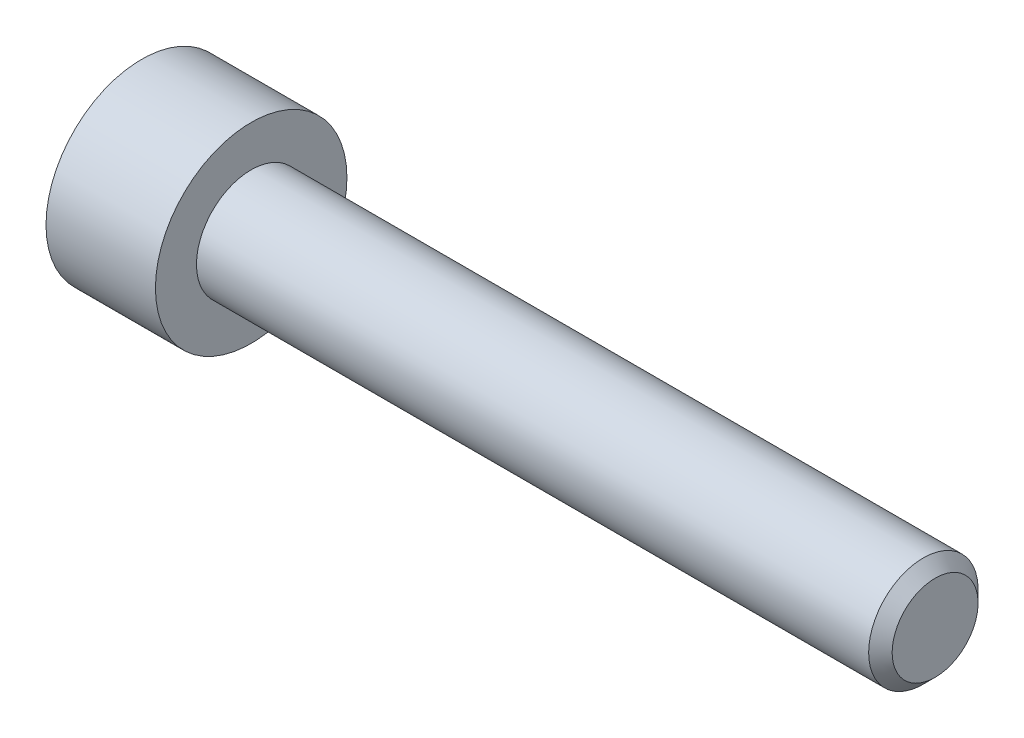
ISO-10303-21;
HEADER;
FILE_DESCRIPTION(('STEP AP214'),'2;1');
FILE_NAME('part.step','',(''),(''),'','','');
FILE_SCHEMA(('AUTOMOTIVE_DESIGN { 1 0 10303 214 1 1 1 1 }'));
ENDSEC;
DATA;
#1=APPLICATION_CONTEXT('core data for automotive mechanical design processes');
#2=APPLICATION_PROTOCOL_DEFINITION('international standard','automotive_design',2000,#1);
#3=PRODUCT_CONTEXT('',#1,'mechanical');
#4=PRODUCT('Part','Part','',(#3));
#5=PRODUCT_RELATED_PRODUCT_CATEGORY('part','',(#4));
#6=PRODUCT_DEFINITION_FORMATION('','',#4);
#7=PRODUCT_DEFINITION_CONTEXT('part definition',#1,'design');
#8=PRODUCT_DEFINITION('design','',#6,#7);
#9=PRODUCT_DEFINITION_SHAPE('','',#8);
#10=(LENGTH_UNIT() NAMED_UNIT(*) SI_UNIT(.MILLI.,.METRE.));
#11=(NAMED_UNIT(*) PLANE_ANGLE_UNIT() SI_UNIT($,.RADIAN.));
#12=(NAMED_UNIT(*) SI_UNIT($,.STERADIAN.) SOLID_ANGLE_UNIT());
#13=UNCERTAINTY_MEASURE_WITH_UNIT(LENGTH_MEASURE(1.E-05),#10,'distance_accuracy_value','');
#14=(GEOMETRIC_REPRESENTATION_CONTEXT(3) GLOBAL_UNCERTAINTY_ASSIGNED_CONTEXT((#13)) GLOBAL_UNIT_ASSIGNED_CONTEXT((#10,
#11,#12)) REPRESENTATION_CONTEXT('',''));
#15=CARTESIAN_POINT('',(0.,0.,0.));
#16=DIRECTION('',(0.,0.,1.));
#17=DIRECTION('',(1.,0.,0.));
#18=AXIS2_PLACEMENT_3D('',#15,#16,#17);
#19=CARTESIAN_POINT('',(-2.,0.86602540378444,1.5));
#20=DIRECTION('',(1.,0.,0.));
#21=DIRECTION('',(0.,0.,-1.));
#22=AXIS2_PLACEMENT_3D('',#19,#20,#21);
#23=PLANE('',#22);
#24=DIRECTION('',(0.,-0.500000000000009,0.866025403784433));
#25=VECTOR('',#24,1.);
#26=CARTESIAN_POINT('',(-2.,1.7320508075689,0.));
#27=LINE('',#26,#25);
#28=CARTESIAN_POINT('',(-2.,1.7320508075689,0.));
#29=VERTEX_POINT('',#28);
#30=CARTESIAN_POINT('',(-2.,0.86602540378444,1.5));
#31=VERTEX_POINT('',#30);
#32=EDGE_CURVE('E132',#29,#31,#27,.T.);
#33=ORIENTED_EDGE('',*,*,#32,.F.);
#34=DIRECTION('',(0.,0.500000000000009,0.866025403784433));
#35=VECTOR('',#34,1.);
#36=CARTESIAN_POINT('',(-2.,0.86602540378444,-1.5));
#37=LINE('',#36,#35);
#38=CARTESIAN_POINT('',(-2.,0.86602540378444,-1.5));
#39=VERTEX_POINT('',#38);
#40=EDGE_CURVE('E54',#39,#29,#37,.T.);
#41=ORIENTED_EDGE('',*,*,#40,.F.);
#42=DIRECTION('',(0.,1.,0.));
#43=VECTOR('',#42,1.);
#44=CARTESIAN_POINT('',(-2.,-0.86602540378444,-1.5));
#45=LINE('',#44,#43);
#46=CARTESIAN_POINT('',(-2.,-0.86602540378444,-1.5));
#47=VERTEX_POINT('',#46);
#48=EDGE_CURVE('E104',#47,#39,#45,.T.);
#49=ORIENTED_EDGE('',*,*,#48,.F.);
#50=DIRECTION('',(0.,0.500000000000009,-0.866025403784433));
#51=VECTOR('',#50,1.);
#52=CARTESIAN_POINT('',(-2.,-1.7320508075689,0.));
#53=LINE('',#52,#51);
#54=CARTESIAN_POINT('',(-2.,-1.7320508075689,0.));
#55=VERTEX_POINT('',#54);
#56=EDGE_CURVE('E97',#55,#47,#53,.T.);
#57=ORIENTED_EDGE('',*,*,#56,.F.);
#58=DIRECTION('',(0.,-0.500000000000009,-0.866025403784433));
#59=VECTOR('',#58,1.);
#60=CARTESIAN_POINT('',(-2.,-0.86602540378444,1.5));
#61=LINE('',#60,#59);
#62=CARTESIAN_POINT('',(-2.,-0.86602540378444,1.5));
#63=VERTEX_POINT('',#62);
#64=EDGE_CURVE('E105',#63,#55,#61,.T.);
#65=ORIENTED_EDGE('',*,*,#64,.F.);
#66=DIRECTION('',(0.,-1.,0.));
#67=VECTOR('',#66,1.);
#68=CARTESIAN_POINT('',(-2.,0.86602540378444,1.5));
#69=LINE('',#68,#67);
#70=EDGE_CURVE('E86',#31,#63,#69,.T.);
#71=ORIENTED_EDGE('',*,*,#70,.F.);
#72=EDGE_LOOP('',(#33,#41,#49,#57,#65,#71));
#73=FACE_BOUND('',#72,.T.);
#74=CARTESIAN_POINT('',(-2.,0.,0.));
#75=DIRECTION('',(-1.,0.,0.));
#76=DIRECTION('',(0.,0.,1.));
#77=AXIS2_PLACEMENT_3D('',#74,#75,#76);
#78=CIRCLE('',#77,1.49);
#79=CARTESIAN_POINT('',(-2.,0.,1.49));
#80=VERTEX_POINT('',#79);
#81=EDGE_CURVE('E120',#80,#80,#78,.T.);
#82=ORIENTED_EDGE('',*,*,#81,.F.);
#83=EDGE_LOOP('',(#82));
#84=FACE_BOUND('',#83,.T.);
#85=ADVANCED_FACE('F31',(#73,#84),#23,.F.);
#86=CARTESIAN_POINT('',(-4.,0.,0.));
#87=DIRECTION('',(1.,0.,0.));
#88=DIRECTION('',(0.,0.,-1.));
#89=AXIS2_PLACEMENT_3D('',#86,#87,#88);
#90=PLANE('',#89);
#91=CARTESIAN_POINT('',(-4.,0.,0.));
#92=DIRECTION('',(-1.,0.,0.));
#93=DIRECTION('',(0.,0.,1.));
#94=AXIS2_PLACEMENT_3D('',#91,#92,#93);
#95=CIRCLE('',#94,3.5);
#96=CARTESIAN_POINT('',(-4.,0.,3.5));
#97=VERTEX_POINT('',#96);
#98=EDGE_CURVE('E11',#97,#97,#95,.T.);
#99=ORIENTED_EDGE('',*,*,#98,.T.);
#100=EDGE_LOOP('',(#99));
#101=FACE_BOUND('',#100,.T.);
#102=DIRECTION('',(0.,-0.500000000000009,0.866025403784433));
#103=VECTOR('',#102,1.);
#104=CARTESIAN_POINT('',(-4.,1.7320508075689,0.));
#105=LINE('',#104,#103);
#106=CARTESIAN_POINT('',(-4.,1.7320508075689,0.));
#107=VERTEX_POINT('',#106);
#108=CARTESIAN_POINT('',(-4.,0.86602540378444,1.5));
#109=VERTEX_POINT('',#108);
#110=EDGE_CURVE('E46',#107,#109,#105,.T.);
#111=ORIENTED_EDGE('',*,*,#110,.T.);
#112=DIRECTION('',(0.,-1.,0.));
#113=VECTOR('',#112,1.);
#114=CARTESIAN_POINT('',(-4.,0.86602540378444,1.5));
#115=LINE('',#114,#113);
#116=CARTESIAN_POINT('',(-4.,-0.86602540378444,1.5));
#117=VERTEX_POINT('',#116);
#118=EDGE_CURVE('E119',#109,#117,#115,.T.);
#119=ORIENTED_EDGE('',*,*,#118,.T.);
#120=DIRECTION('',(0.,-0.500000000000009,-0.866025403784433));
#121=VECTOR('',#120,1.);
#122=CARTESIAN_POINT('',(-4.,-0.86602540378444,1.5));
#123=LINE('',#122,#121);
#124=CARTESIAN_POINT('',(-4.,-1.7320508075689,0.));
#125=VERTEX_POINT('',#124);
#126=EDGE_CURVE('E123',#117,#125,#123,.T.);
#127=ORIENTED_EDGE('',*,*,#126,.T.);
#128=DIRECTION('',(0.,0.500000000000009,-0.866025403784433));
#129=VECTOR('',#128,1.);
#130=CARTESIAN_POINT('',(-4.,-1.7320508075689,0.));
#131=LINE('',#130,#129);
#132=CARTESIAN_POINT('',(-4.,-0.86602540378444,-1.5));
#133=VERTEX_POINT('',#132);
#134=EDGE_CURVE('E126',#125,#133,#131,.T.);
#135=ORIENTED_EDGE('',*,*,#134,.T.);
#136=DIRECTION('',(0.,1.,0.));
#137=VECTOR('',#136,1.);
#138=CARTESIAN_POINT('',(-4.,-0.86602540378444,-1.5));
#139=LINE('',#138,#137);
#140=CARTESIAN_POINT('',(-4.,0.86602540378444,-1.5));
#141=VERTEX_POINT('',#140);
#142=EDGE_CURVE('E109',#133,#141,#139,.T.);
#143=ORIENTED_EDGE('',*,*,#142,.T.);
#144=DIRECTION('',(0.,0.500000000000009,0.866025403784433));
#145=VECTOR('',#144,1.);
#146=CARTESIAN_POINT('',(-4.,0.86602540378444,-1.5));
#147=LINE('',#146,#145);
#148=EDGE_CURVE('E129',#141,#107,#147,.T.);
#149=ORIENTED_EDGE('',*,*,#148,.T.);
#150=EDGE_LOOP('',(#111,#119,#127,#135,#143,#149));
#151=FACE_BOUND('',#150,.T.);
#152=ADVANCED_FACE('F33',(#101,#151),#90,.F.);
#153=CARTESIAN_POINT('',(25.,0.,0.));
#154=DIRECTION('',(-1.,0.,0.));
#155=DIRECTION('',(0.,0.,1.));
#156=AXIS2_PLACEMENT_3D('',#153,#154,#155);
#157=CYLINDRICAL_SURFACE('',#156,3.5);
#158=ORIENTED_EDGE('',*,*,#98,.F.);
#159=EDGE_LOOP('',(#158));
#160=FACE_BOUND('',#159,.T.);
#161=CARTESIAN_POINT('',(0.,0.,0.));
#162=DIRECTION('',(-1.,0.,0.));
#163=DIRECTION('',(0.,0.,1.));
#164=AXIS2_PLACEMENT_3D('',#161,#162,#163);
#165=CIRCLE('',#164,3.5);
#166=CARTESIAN_POINT('',(0.,0.,3.5));
#167=VERTEX_POINT('',#166);
#168=EDGE_CURVE('E39',#167,#167,#165,.T.);
#169=ORIENTED_EDGE('',*,*,#168,.T.);
#170=EDGE_LOOP('',(#169));
#171=FACE_BOUND('',#170,.T.);
#172=ADVANCED_FACE('F151',(#160,#171),#157,.T.);
#173=CARTESIAN_POINT('',(0.,3.5,0.));
#174=DIRECTION('',(-1.,0.,0.));
#175=DIRECTION('',(0.,0.,1.));
#176=AXIS2_PLACEMENT_3D('',#173,#174,#175);
#177=PLANE('',#176);
#178=ORIENTED_EDGE('',*,*,#168,.F.);
#179=EDGE_LOOP('',(#178));
#180=FACE_BOUND('',#179,.T.);
#181=CARTESIAN_POINT('',(0.,0.,0.));
#182=DIRECTION('',(-1.,0.,0.));
#183=DIRECTION('',(0.,0.,1.));
#184=AXIS2_PLACEMENT_3D('',#181,#182,#183);
#185=CIRCLE('',#184,2.);
#186=CARTESIAN_POINT('',(0.,0.,2.));
#187=VERTEX_POINT('',#186);
#188=EDGE_CURVE('E146',#187,#187,#185,.T.);
#189=ORIENTED_EDGE('',*,*,#188,.T.);
#190=EDGE_LOOP('',(#189));
#191=FACE_BOUND('',#190,.T.);
#192=ADVANCED_FACE('F153',(#180,#191),#177,.F.);
#193=CARTESIAN_POINT('',(25.,0.,0.));
#194=DIRECTION('',(-1.,0.,0.));
#195=DIRECTION('',(0.,0.,1.));
#196=AXIS2_PLACEMENT_3D('',#193,#194,#195);
#197=CYLINDRICAL_SURFACE('',#196,2.);
#198=ORIENTED_EDGE('',*,*,#188,.F.);
#199=EDGE_LOOP('',(#198));
#200=FACE_BOUND('',#199,.T.);
#201=CARTESIAN_POINT('',(24.5705,0.,0.));
#202=DIRECTION('',(-1.,0.,0.));
#203=DIRECTION('',(0.,0.,1.));
#204=AXIS2_PLACEMENT_3D('',#201,#202,#203);
#205=CIRCLE('',#204,2.);
#206=CARTESIAN_POINT('',(24.5705,0.,2.));
#207=VERTEX_POINT('',#206);
#208=EDGE_CURVE('E143',#207,#207,#205,.T.);
#209=ORIENTED_EDGE('',*,*,#208,.T.);
#210=EDGE_LOOP('',(#209));
#211=FACE_BOUND('',#210,.T.);
#212=ADVANCED_FACE('F156',(#200,#211),#197,.T.);
#213=CARTESIAN_POINT('',(25.,0.,0.));
#214=DIRECTION('',(-1.,0.,0.));
#215=DIRECTION('',(0.,0.,1.));
#216=AXIS2_PLACEMENT_3D('',#213,#214,#215);
#217=CONICAL_SURFACE('',#216,1.5705,0.785398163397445);
#218=ORIENTED_EDGE('',*,*,#208,.F.);
#219=EDGE_LOOP('',(#218));
#220=FACE_BOUND('',#219,.T.);
#221=CARTESIAN_POINT('',(25.,0.,0.));
#222=DIRECTION('',(-1.,0.,0.));
#223=DIRECTION('',(0.,0.,1.));
#224=AXIS2_PLACEMENT_3D('',#221,#222,#223);
#225=CIRCLE('',#224,1.5705);
#226=CARTESIAN_POINT('',(25.,0.,1.5705));
#227=VERTEX_POINT('',#226);
#228=EDGE_CURVE('E140',#227,#227,#225,.T.);
#229=ORIENTED_EDGE('',*,*,#228,.T.);
#230=EDGE_LOOP('',(#229));
#231=FACE_BOUND('',#230,.T.);
#232=ADVANCED_FACE('F162',(#220,#231),#217,.T.);
#233=CARTESIAN_POINT('',(25.,1.5705,0.));
#234=DIRECTION('',(-1.,0.,0.));
#235=DIRECTION('',(0.,0.,1.));
#236=AXIS2_PLACEMENT_3D('',#233,#234,#235);
#237=PLANE('',#236);
#238=ORIENTED_EDGE('',*,*,#228,.F.);
#239=EDGE_LOOP('',(#238));
#240=FACE_BOUND('',#239,.T.);
#241=ADVANCED_FACE('F168',(#240),#237,.F.);
#242=CARTESIAN_POINT('',(-2.,1.7320508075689,0.));
#243=DIRECTION('',(0.,-0.866025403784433,-0.500000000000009));
#244=DIRECTION('',(0.,0.500000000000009,-0.866025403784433));
#245=AXIS2_PLACEMENT_3D('',#242,#243,#244);
#246=PLANE('',#245);
#247=ORIENTED_EDGE('',*,*,#110,.F.);
#248=DIRECTION('',(-1.,0.,0.));
#249=VECTOR('',#248,1.);
#250=CARTESIAN_POINT('',(-2.,1.7320508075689,0.));
#251=LINE('',#250,#249);
#252=EDGE_CURVE('E114',#29,#107,#251,.T.);
#253=ORIENTED_EDGE('',*,*,#252,.F.);
#254=ORIENTED_EDGE('',*,*,#32,.T.);
#255=DIRECTION('',(-1.,0.,0.));
#256=VECTOR('',#255,1.);
#257=CARTESIAN_POINT('',(-2.,0.86602540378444,1.5));
#258=LINE('',#257,#256);
#259=EDGE_CURVE('E138',#31,#109,#258,.T.);
#260=ORIENTED_EDGE('',*,*,#259,.T.);
#261=EDGE_LOOP('',(#247,#253,#254,#260));
#262=FACE_BOUND('',#261,.T.);
#263=ADVANCED_FACE('F173',(#262),#246,.T.);
#264=CARTESIAN_POINT('',(-2.,0.86602540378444,1.5));
#265=DIRECTION('',(0.,0.,-1.));
#266=DIRECTION('',(-1.,0.,0.));
#267=AXIS2_PLACEMENT_3D('',#264,#265,#266);
#268=PLANE('',#267);
#269=ORIENTED_EDGE('',*,*,#118,.F.);
#270=ORIENTED_EDGE('',*,*,#259,.F.);
#271=ORIENTED_EDGE('',*,*,#70,.T.);
#272=DIRECTION('',(-1.,0.,0.));
#273=VECTOR('',#272,1.);
#274=CARTESIAN_POINT('',(-2.,-0.86602540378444,1.5));
#275=LINE('',#274,#273);
#276=EDGE_CURVE('E136',#63,#117,#275,.T.);
#277=ORIENTED_EDGE('',*,*,#276,.T.);
#278=EDGE_LOOP('',(#269,#270,#271,#277));
#279=FACE_BOUND('',#278,.T.);
#280=ADVANCED_FACE('F178',(#279),#268,.T.);
#281=CARTESIAN_POINT('',(-2.,-0.86602540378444,1.5));
#282=DIRECTION('',(0.,0.866025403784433,-0.500000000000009));
#283=DIRECTION('',(0.,0.500000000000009,0.866025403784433));
#284=AXIS2_PLACEMENT_3D('',#281,#282,#283);
#285=PLANE('',#284);
#286=ORIENTED_EDGE('',*,*,#126,.F.);
#287=ORIENTED_EDGE('',*,*,#276,.F.);
#288=ORIENTED_EDGE('',*,*,#64,.T.);
#289=DIRECTION('',(-1.,0.,0.));
#290=VECTOR('',#289,1.);
#291=CARTESIAN_POINT('',(-2.,-1.7320508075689,0.));
#292=LINE('',#291,#290);
#293=EDGE_CURVE('E102',#55,#125,#292,.T.);
#294=ORIENTED_EDGE('',*,*,#293,.T.);
#295=EDGE_LOOP('',(#286,#287,#288,#294));
#296=FACE_BOUND('',#295,.T.);
#297=ADVANCED_FACE('F196',(#296),#285,.T.);
#298=CARTESIAN_POINT('',(-2.,-1.7320508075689,0.));
#299=DIRECTION('',(0.,0.866025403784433,0.500000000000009));
#300=DIRECTION('',(0.,-0.500000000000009,0.866025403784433));
#301=AXIS2_PLACEMENT_3D('',#298,#299,#300);
#302=PLANE('',#301);
#303=ORIENTED_EDGE('',*,*,#134,.F.);
#304=ORIENTED_EDGE('',*,*,#293,.F.);
#305=ORIENTED_EDGE('',*,*,#56,.T.);
#306=DIRECTION('',(-1.,0.,0.));
#307=VECTOR('',#306,1.);
#308=CARTESIAN_POINT('',(-2.,-0.86602540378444,-1.5));
#309=LINE('',#308,#307);
#310=EDGE_CURVE('E101',#47,#133,#309,.T.);
#311=ORIENTED_EDGE('',*,*,#310,.T.);
#312=EDGE_LOOP('',(#303,#304,#305,#311));
#313=FACE_BOUND('',#312,.T.);
#314=ADVANCED_FACE('F100',(#313),#302,.T.);
#315=CARTESIAN_POINT('',(-2.,-0.86602540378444,-1.5));
#316=DIRECTION('',(0.,0.,1.));
#317=DIRECTION('',(1.,0.,0.));
#318=AXIS2_PLACEMENT_3D('',#315,#316,#317);
#319=PLANE('',#318);
#320=ORIENTED_EDGE('',*,*,#142,.F.);
#321=ORIENTED_EDGE('',*,*,#310,.F.);
#322=ORIENTED_EDGE('',*,*,#48,.T.);
#323=DIRECTION('',(-1.,0.,0.));
#324=VECTOR('',#323,1.);
#325=CARTESIAN_POINT('',(-2.,0.86602540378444,-1.5));
#326=LINE('',#325,#324);
#327=EDGE_CURVE('E77',#39,#141,#326,.T.);
#328=ORIENTED_EDGE('',*,*,#327,.T.);
#329=EDGE_LOOP('',(#320,#321,#322,#328));
#330=FACE_BOUND('',#329,.T.);
#331=ADVANCED_FACE('F107',(#330),#319,.T.);
#332=CARTESIAN_POINT('',(-2.,0.86602540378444,-1.5));
#333=DIRECTION('',(0.,-0.866025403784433,0.500000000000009));
#334=DIRECTION('',(0.,-0.500000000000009,-0.866025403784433));
#335=AXIS2_PLACEMENT_3D('',#332,#333,#334);
#336=PLANE('',#335);
#337=ORIENTED_EDGE('',*,*,#148,.F.);
#338=ORIENTED_EDGE('',*,*,#327,.F.);
#339=ORIENTED_EDGE('',*,*,#40,.T.);
#340=ORIENTED_EDGE('',*,*,#252,.T.);
#341=EDGE_LOOP('',(#337,#338,#339,#340));
#342=FACE_BOUND('',#341,.T.);
#343=ADVANCED_FACE('F189',(#342),#336,.T.);
#344=CARTESIAN_POINT('',(-1.1397480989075,0.,0.));
#345=DIRECTION('',(-1.,0.,0.));
#346=DIRECTION('',(0.,0.,1.));
#347=AXIS2_PLACEMENT_3D('',#344,#345,#346);
#348=CONICAL_SURFACE('',#347,0.,1.04719755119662);
#349=ORIENTED_EDGE('',*,*,#81,.T.);
#350=EDGE_LOOP('',(#349));
#351=FACE_BOUND('',#350,.T.);
#352=CARTESIAN_POINT('',(-1.1397480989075,0.,0.));
#353=VERTEX_POINT('',#352);
#354=VERTEX_LOOP('',#353);
#355=FACE_BOUND('',#354,.T.);
#356=ADVANCED_FACE('F188',(#351,#355),#348,.F.);
#357=CLOSED_SHELL('',(#85,#152,#172,#192,#212,#232,#241,#263,#280,#297,#314,#331,#343,#356));
#358=MANIFOLD_SOLID_BREP('B2',#357);
#359=ADVANCED_BREP_SHAPE_REPRESENTATION('',(#18,#358),#14);
#360=SHAPE_DEFINITION_REPRESENTATION(#9,#359);
ENDSEC;
END-ISO-10303-21;
